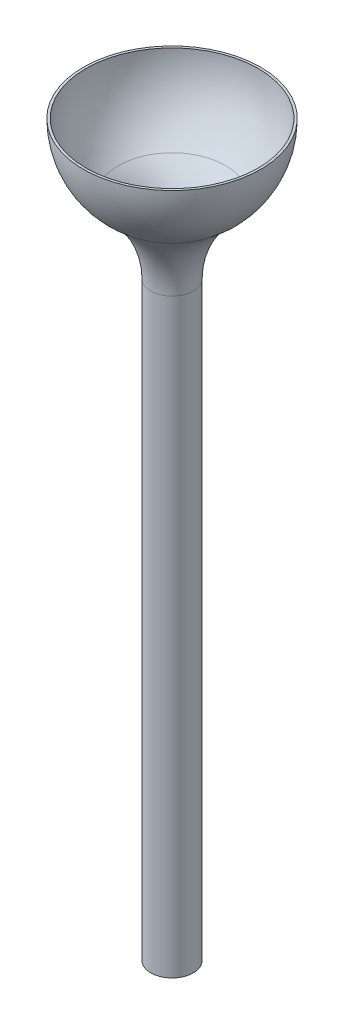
from build123d import *

# Parameters (mm, degrees)
THICKEN1_T1 = 0.2


with BuildPart() as body_1:
    # Surface-Revolve1: a surface, the sketch's curves turned about an axis
    with BuildLine(Plane.XY, mode=Mode.PRIVATE) as surface_revolve1_1_path:
        Line((1.8, 0), (1.8, 50))
        ThreePointArc((1.8, 50), (2.55, 53.269174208), (4.65, 55.884513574))
        ThreePointArc((4.65, 55.884513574), (6.75, 58.49985294), (7.5, 61.769027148))
    surface_revolve1_1 = Shell.revolve(surface_revolve1_1_path.wire(), 360, Axis((0, 61.769027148, 0), (0, -1, 0)))
    add(Solid.thicken(surface_revolve1_1, THICKEN1_T1))


solid = body_1.part
